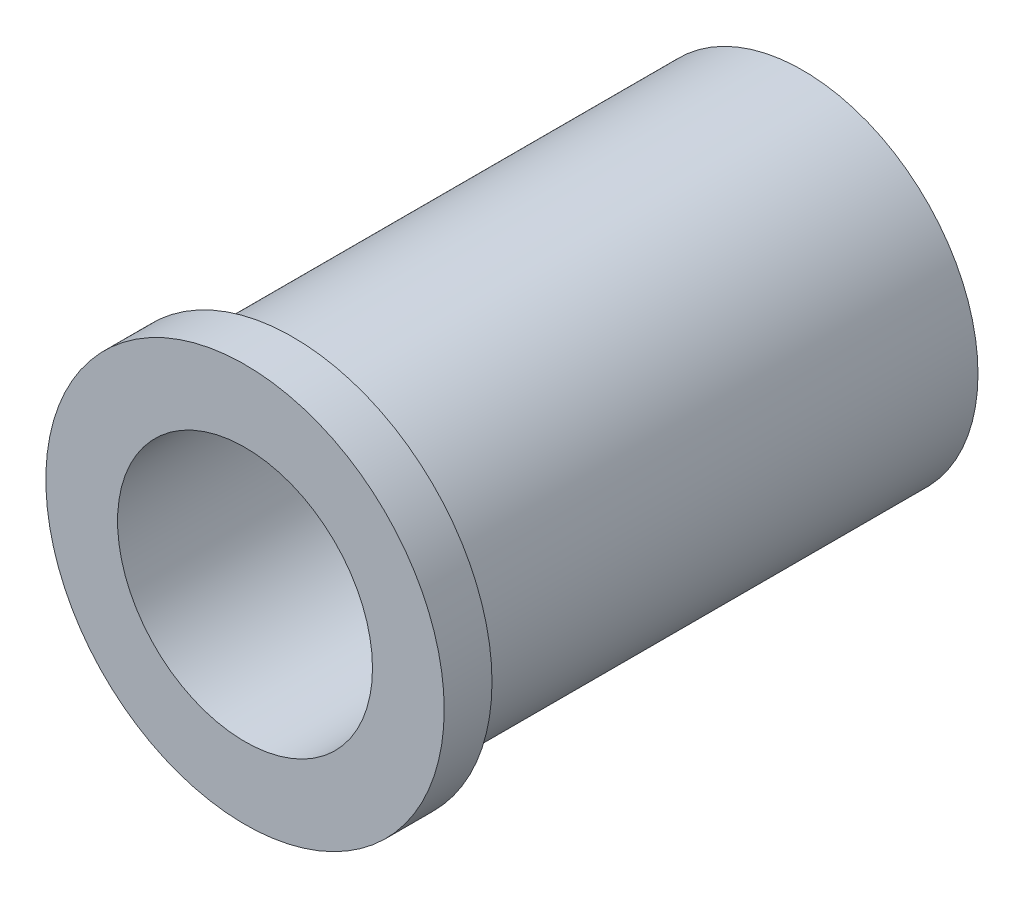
ISO-10303-21;
HEADER;
FILE_DESCRIPTION(('STEP AP214'),'2;1');
FILE_NAME('part.step','',(''),(''),'','','');
FILE_SCHEMA(('AUTOMOTIVE_DESIGN { 1 0 10303 214 1 1 1 1 }'));
ENDSEC;
DATA;
#1=APPLICATION_CONTEXT('core data for automotive mechanical design processes');
#2=APPLICATION_PROTOCOL_DEFINITION('international standard','automotive_design',2000,#1);
#3=PRODUCT_CONTEXT('',#1,'mechanical');
#4=PRODUCT('Part','Part','',(#3));
#5=PRODUCT_RELATED_PRODUCT_CATEGORY('part','',(#4));
#6=PRODUCT_DEFINITION_FORMATION('','',#4);
#7=PRODUCT_DEFINITION_CONTEXT('part definition',#1,'design');
#8=PRODUCT_DEFINITION('design','',#6,#7);
#9=PRODUCT_DEFINITION_SHAPE('','',#8);
#10=(LENGTH_UNIT() NAMED_UNIT(*) SI_UNIT(.MILLI.,.METRE.));
#11=(NAMED_UNIT(*) PLANE_ANGLE_UNIT() SI_UNIT($,.RADIAN.));
#12=(NAMED_UNIT(*) SI_UNIT($,.STERADIAN.) SOLID_ANGLE_UNIT());
#13=UNCERTAINTY_MEASURE_WITH_UNIT(LENGTH_MEASURE(1.E-05),#10,'distance_accuracy_value','');
#14=(GEOMETRIC_REPRESENTATION_CONTEXT(3) GLOBAL_UNCERTAINTY_ASSIGNED_CONTEXT((#13)) GLOBAL_UNIT_ASSIGNED_CONTEXT((#10,
#11,#12)) REPRESENTATION_CONTEXT('',''));
#15=CARTESIAN_POINT('',(0.,0.,0.));
#16=DIRECTION('',(0.,0.,1.));
#17=DIRECTION('',(1.,0.,0.));
#18=AXIS2_PLACEMENT_3D('',#15,#16,#17);
#19=CARTESIAN_POINT('',(0.,0.,32.));
#20=DIRECTION('',(0.,0.,-1.));
#21=DIRECTION('',(-1.,0.,0.));
#22=AXIS2_PLACEMENT_3D('',#19,#20,#21);
#23=CYLINDRICAL_SURFACE('',#22,11.);
#24=CARTESIAN_POINT('',(0.,0.,32.));
#25=DIRECTION('',(0.,0.,1.));
#26=DIRECTION('',(1.,0.,0.));
#27=AXIS2_PLACEMENT_3D('',#24,#25,#26);
#28=CIRCLE('',#27,11.);
#29=CARTESIAN_POINT('',(11.,0.,32.));
#30=VERTEX_POINT('',#29);
#31=EDGE_CURVE('E10',#30,#30,#28,.T.);
#32=ORIENTED_EDGE('',*,*,#31,.F.);
#33=EDGE_LOOP('',(#32));
#34=FACE_BOUND('',#33,.T.);
#35=CARTESIAN_POINT('',(0.,0.,0.));
#36=DIRECTION('',(0.,0.,1.));
#37=DIRECTION('',(1.,0.,0.));
#38=AXIS2_PLACEMENT_3D('',#35,#36,#37);
#39=CIRCLE('',#38,11.);
#40=CARTESIAN_POINT('',(11.,0.,0.));
#41=VERTEX_POINT('',#40);
#42=EDGE_CURVE('E33',#41,#41,#39,.T.);
#43=ORIENTED_EDGE('',*,*,#42,.T.);
#44=EDGE_LOOP('',(#43));
#45=FACE_BOUND('',#44,.T.);
#46=ADVANCED_FACE('F30',(#34,#45),#23,.T.);
#47=CARTESIAN_POINT('',(0.,0.,0.));
#48=DIRECTION('',(0.,0.,1.));
#49=DIRECTION('',(1.,0.,0.));
#50=AXIS2_PLACEMENT_3D('',#47,#48,#49);
#51=PLANE('',#50);
#52=CARTESIAN_POINT('',(0.,0.,0.));
#53=DIRECTION('',(0.,0.,1.));
#54=DIRECTION('',(1.,0.,0.));
#55=AXIS2_PLACEMENT_3D('',#52,#53,#54);
#56=CIRCLE('',#55,8.);
#57=CARTESIAN_POINT('',(8.,0.,0.));
#58=VERTEX_POINT('',#57);
#59=EDGE_CURVE('E45',#58,#58,#56,.T.);
#60=ORIENTED_EDGE('',*,*,#59,.T.);
#61=EDGE_LOOP('',(#60));
#62=FACE_BOUND('',#61,.T.);
#63=ORIENTED_EDGE('',*,*,#42,.F.);
#64=EDGE_LOOP('',(#63));
#65=FACE_BOUND('',#64,.T.);
#66=ADVANCED_FACE('F54',(#62,#65),#51,.F.);
#67=CARTESIAN_POINT('',(0.,0.,32.));
#68=DIRECTION('',(0.,0.,1.));
#69=DIRECTION('',(1.,0.,0.));
#70=AXIS2_PLACEMENT_3D('',#67,#68,#69);
#71=PLANE('',#70);
#72=CARTESIAN_POINT('',(0.,0.,32.));
#73=DIRECTION('',(0.,0.,1.));
#74=DIRECTION('',(1.,0.,0.));
#75=AXIS2_PLACEMENT_3D('',#72,#73,#74);
#76=CIRCLE('',#75,12.5);
#77=CARTESIAN_POINT('',(12.5,0.,32.));
#78=VERTEX_POINT('',#77);
#79=EDGE_CURVE('E42',#78,#78,#76,.T.);
#80=ORIENTED_EDGE('',*,*,#79,.F.);
#81=EDGE_LOOP('',(#80));
#82=FACE_BOUND('',#81,.T.);
#83=ORIENTED_EDGE('',*,*,#31,.T.);
#84=EDGE_LOOP('',(#83));
#85=FACE_BOUND('',#84,.T.);
#86=ADVANCED_FACE('F72',(#82,#85),#71,.F.);
#87=CARTESIAN_POINT('',(0.,0.,35.));
#88=DIRECTION('',(0.,0.,-1.));
#89=DIRECTION('',(-1.,0.,0.));
#90=AXIS2_PLACEMENT_3D('',#87,#88,#89);
#91=CYLINDRICAL_SURFACE('',#90,12.5);
#92=CARTESIAN_POINT('',(0.,0.,35.));
#93=DIRECTION('',(0.,0.,1.));
#94=DIRECTION('',(1.,0.,0.));
#95=AXIS2_PLACEMENT_3D('',#92,#93,#94);
#96=CIRCLE('',#95,12.5);
#97=CARTESIAN_POINT('',(12.5,0.,35.));
#98=VERTEX_POINT('',#97);
#99=EDGE_CURVE('E40',#98,#98,#96,.T.);
#100=ORIENTED_EDGE('',*,*,#99,.F.);
#101=EDGE_LOOP('',(#100));
#102=FACE_BOUND('',#101,.T.);
#103=ORIENTED_EDGE('',*,*,#79,.T.);
#104=EDGE_LOOP('',(#103));
#105=FACE_BOUND('',#104,.T.);
#106=ADVANCED_FACE('F66',(#102,#105),#91,.T.);
#107=CARTESIAN_POINT('',(0.,0.,35.));
#108=DIRECTION('',(0.,0.,1.));
#109=DIRECTION('',(1.,0.,0.));
#110=AXIS2_PLACEMENT_3D('',#107,#108,#109);
#111=PLANE('',#110);
#112=CARTESIAN_POINT('',(0.,0.,35.));
#113=DIRECTION('',(0.,0.,1.));
#114=DIRECTION('',(1.,0.,0.));
#115=AXIS2_PLACEMENT_3D('',#112,#113,#114);
#116=CIRCLE('',#115,8.);
#117=CARTESIAN_POINT('',(8.,0.,35.));
#118=VERTEX_POINT('',#117);
#119=EDGE_CURVE('E48',#118,#118,#116,.T.);
#120=ORIENTED_EDGE('',*,*,#119,.F.);
#121=EDGE_LOOP('',(#120));
#122=FACE_BOUND('',#121,.T.);
#123=ORIENTED_EDGE('',*,*,#99,.T.);
#124=EDGE_LOOP('',(#123));
#125=FACE_BOUND('',#124,.T.);
#126=ADVANCED_FACE('F60',(#122,#125),#111,.T.);
#127=CARTESIAN_POINT('',(0.,0.,0.));
#128=DIRECTION('',(0.,0.,1.));
#129=DIRECTION('',(1.,0.,0.));
#130=AXIS2_PLACEMENT_3D('',#127,#128,#129);
#131=CYLINDRICAL_SURFACE('',#130,8.);
#132=ORIENTED_EDGE('',*,*,#59,.F.);
#133=EDGE_LOOP('',(#132));
#134=FACE_BOUND('',#133,.T.);
#135=ORIENTED_EDGE('',*,*,#119,.T.);
#136=EDGE_LOOP('',(#135));
#137=FACE_BOUND('',#136,.T.);
#138=ADVANCED_FACE('F57',(#134,#137),#131,.F.);
#139=CLOSED_SHELL('',(#46,#66,#86,#106,#126,#138));
#140=MANIFOLD_SOLID_BREP('B2',#139);
#141=ADVANCED_BREP_SHAPE_REPRESENTATION('',(#18,#140),#14);
#142=SHAPE_DEFINITION_REPRESENTATION(#9,#141);
ENDSEC;
END-ISO-10303-21;
